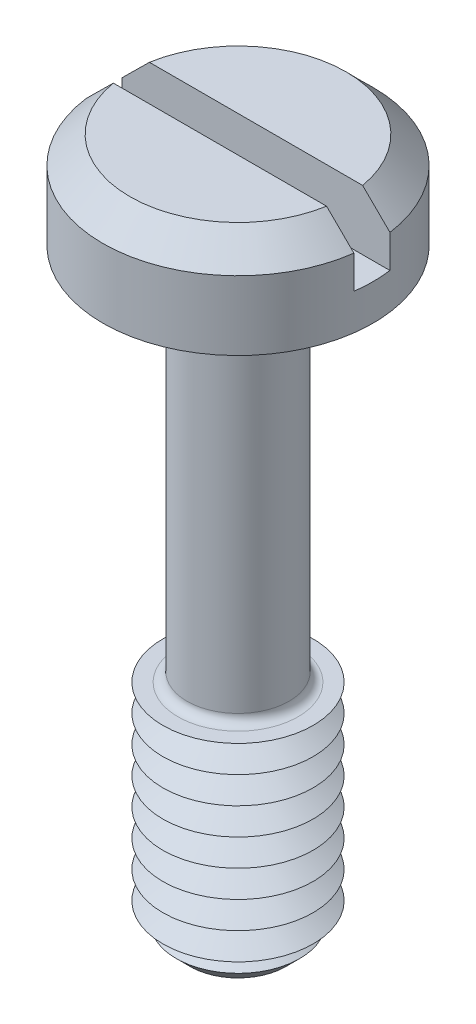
from build123d import *

# Parameters (mm, degrees)
SKETCH1_R           = 2.25
BOSS_EXTRUDE1_DEPTH = 1.6
SKETCH2_R           = 0.85
BOSS_EXTRUDE2_DEPTH = 10
SKETCH3_R           = 1.25
BOSS_EXTRUDE3_DEPTH = 3.7
CHAMFER1_SIZE       = 0.45
LPATTERN1_COUNT     = 8
LPATTERN1_PITCH     = 0.45
FILLET1_R           = 0.15
CHAMFER2_SIZE       = 0.45
SKETCH6_W           = 4.5
SKETCH6_H           = 0.6
CUT_EXTRUDE1_DEPTH  = 1


with BuildPart() as part:
    # Sketch1 → Boss-Extrude1 (new body)
    with BuildSketch(Plane(origin=(0, 0, 0), x_dir=(1, 0, 0), z_dir=(0, 1, 0))):
        with Locations(Location((0, 0, 0), (0, 0, 270))):
            Circle(SKETCH1_R)
    extrude(amount=BOSS_EXTRUDE1_DEPTH)

    # Sketch2 → Boss-Extrude2 (add)
    with BuildSketch(Plane.XZ):
        with Locations(Location((0, 0, 0), (0, 0, 270))):
            Circle(SKETCH2_R)
    extrude(amount=BOSS_EXTRUDE2_DEPTH)

    # Sketch3 → Boss-Extrude3 (add)
    with BuildSketch(Plane.XZ.offset(10)):
        with Locations(Location((0, 0, 0), (0, 0, 270))):
            Circle(SKETCH3_R)
    extrude(amount=-BOSS_EXTRUDE3_DEPTH)

    # Chamfer1
    chamfer1_edges = [part.edges().sort_by_distance(p)[0] for p in [
        (0, -10, 1.25),
    ]]
    chamfer(chamfer1_edges, length=CHAMFER1_SIZE)

    # Sketch5 → Cut-Revolve1 (revolve, cut)
    with BuildSketch(Plane(origin=(0, 0, 0), x_dir=(0, 0, -1), z_dir=(1, 0, 0))):
        Polygon((-1.25, -6.3), (-0.860288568, -6.525), (-1.25, -6.75), align=None)
    cut_revolve1 = revolve(axis=Axis((0, -6.58711856, 0), (0, -1, 0)), mode=Mode.SUBTRACT)

    # LPattern1: Cut-Revolve1 ×8
    with Locations(*[(0, -i * LPATTERN1_PITCH, 0) for i in range(1, LPATTERN1_COUNT)]):
        add(cut_revolve1, mode=Mode.SUBTRACT)

    # Fillet1
    fillet1_edges = [part.edges().sort_by_distance(p)[0] for p in [
        (0, 0, 0.85),
        (0, -6.3, 0.85),
    ]]
    fillet(fillet1_edges, radius=FILLET1_R)

    # Chamfer2
    chamfer2_edges = [part.edges().sort_by_distance(p)[0] for p in [
        (0, 1.6, -2.25),
    ]]
    chamfer(chamfer2_edges, length=CHAMFER2_SIZE)

    # Sketch6 → Cut-Extrude1 (cut)
    with BuildSketch(Plane(origin=(0, 1.6, 0), x_dir=(1, 0, 0), z_dir=(0, 1, 0))):
        Rectangle(SKETCH6_W, SKETCH6_H)
    extrude(amount=-CUT_EXTRUDE1_DEPTH, mode=Mode.SUBTRACT)


solid = part.part
